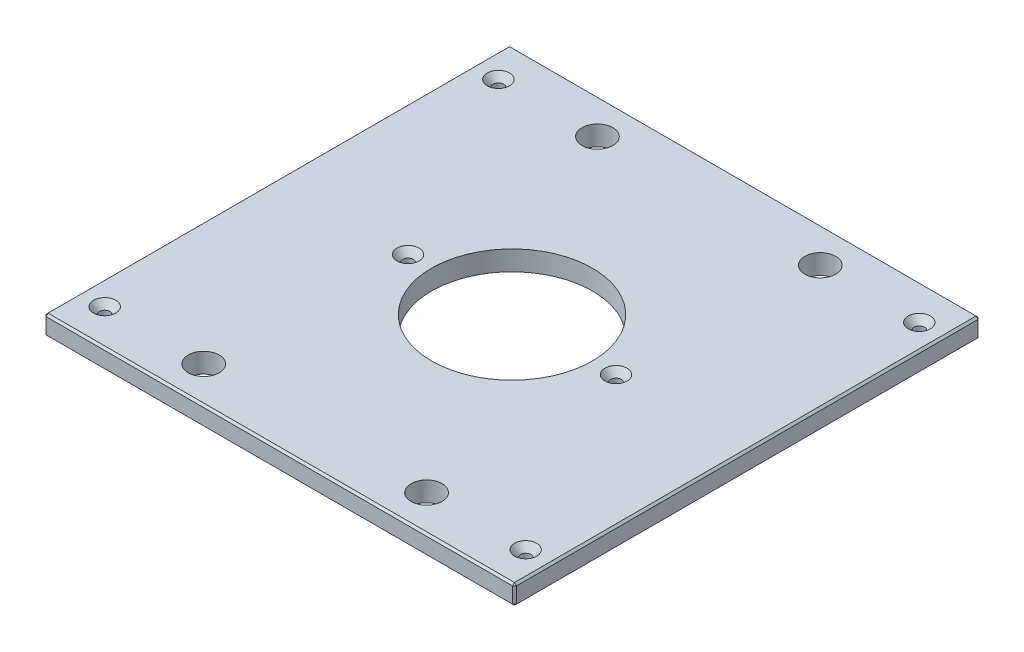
ISO-10303-21;
HEADER;
FILE_DESCRIPTION(('STEP AP214'),'2;1');
FILE_NAME('part.step','',(''),(''),'','','');
FILE_SCHEMA(('AUTOMOTIVE_DESIGN { 1 0 10303 214 1 1 1 1 }'));
ENDSEC;
DATA;
#1=APPLICATION_CONTEXT('core data for automotive mechanical design processes');
#2=APPLICATION_PROTOCOL_DEFINITION('international standard','automotive_design',2000,#1);
#3=PRODUCT_CONTEXT('',#1,'mechanical');
#4=PRODUCT('Part','Part','',(#3));
#5=PRODUCT_RELATED_PRODUCT_CATEGORY('part','',(#4));
#6=PRODUCT_DEFINITION_FORMATION('','',#4);
#7=PRODUCT_DEFINITION_CONTEXT('part definition',#1,'design');
#8=PRODUCT_DEFINITION('design','',#6,#7);
#9=PRODUCT_DEFINITION_SHAPE('','',#8);
#10=(LENGTH_UNIT() NAMED_UNIT(*) SI_UNIT(.MILLI.,.METRE.));
#11=(NAMED_UNIT(*) PLANE_ANGLE_UNIT() SI_UNIT($,.RADIAN.));
#12=(NAMED_UNIT(*) SI_UNIT($,.STERADIAN.) SOLID_ANGLE_UNIT());
#13=UNCERTAINTY_MEASURE_WITH_UNIT(LENGTH_MEASURE(1.E-05),#10,'distance_accuracy_value','');
#14=(GEOMETRIC_REPRESENTATION_CONTEXT(3) GLOBAL_UNCERTAINTY_ASSIGNED_CONTEXT((#13)) GLOBAL_UNIT_ASSIGNED_CONTEXT((#10,
#11,#12)) REPRESENTATION_CONTEXT('',''));
#15=CARTESIAN_POINT('',(0.,0.,0.));
#16=DIRECTION('',(0.,0.,1.));
#17=DIRECTION('',(1.,0.,0.));
#18=AXIS2_PLACEMENT_3D('',#15,#16,#17);
#19=CARTESIAN_POINT('',(-150.8125,12.7,-149.225));
#20=DIRECTION('',(1.,0.,0.));
#21=DIRECTION('',(0.,0.,-1.));
#22=AXIS2_PLACEMENT_3D('',#19,#20,#21);
#23=PLANE('',#22);
#24=DIRECTION('',(0.,0.,-1.));
#25=VECTOR('',#24,1.);
#26=CARTESIAN_POINT('',(-150.8125,11.43,-149.225));
#27=LINE('',#26,#25);
#28=CARTESIAN_POINT('',(-150.8125,11.43,147.955));
#29=VERTEX_POINT('',#28);
#30=CARTESIAN_POINT('',(-150.8125,11.43,-147.955));
#31=VERTEX_POINT('',#30);
#32=EDGE_CURVE('E135',#29,#31,#27,.T.);
#33=ORIENTED_EDGE('',*,*,#32,.T.);
#34=DIRECTION('',(0.,-1.,0.));
#35=VECTOR('',#34,1.);
#36=CARTESIAN_POINT('',(-150.8125,12.7,-147.955));
#37=LINE('',#36,#35);
#38=CARTESIAN_POINT('',(-150.8125,1.26999999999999,-147.955));
#39=VERTEX_POINT('',#38);
#40=EDGE_CURVE('E131',#31,#39,#37,.T.);
#41=ORIENTED_EDGE('',*,*,#40,.T.);
#42=DIRECTION('',(0.,0.,1.));
#43=VECTOR('',#42,1.);
#44=CARTESIAN_POINT('',(-150.8125,1.26999999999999,-149.225));
#45=LINE('',#44,#43);
#46=CARTESIAN_POINT('',(-150.8125,1.26999999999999,147.955));
#47=VERTEX_POINT('',#46);
#48=EDGE_CURVE('E126',#39,#47,#45,.T.);
#49=ORIENTED_EDGE('',*,*,#48,.T.);
#50=DIRECTION('',(0.,1.,0.));
#51=VECTOR('',#50,1.);
#52=CARTESIAN_POINT('',(-150.8125,12.7,147.955));
#53=LINE('',#52,#51);
#54=EDGE_CURVE('E128',#47,#29,#53,.T.);
#55=ORIENTED_EDGE('',*,*,#54,.T.);
#56=EDGE_LOOP('',(#33,#41,#49,#55));
#57=FACE_BOUND('',#56,.T.);
#58=ADVANCED_FACE('F35',(#57),#23,.F.);
#59=CARTESIAN_POINT('',(-150.8125,12.7,149.225));
#60=DIRECTION('',(0.,0.,-1.));
#61=DIRECTION('',(-1.,0.,0.));
#62=AXIS2_PLACEMENT_3D('',#59,#60,#61);
#63=PLANE('',#62);
#64=DIRECTION('',(1.,0.,0.));
#65=VECTOR('',#64,1.);
#66=CARTESIAN_POINT('',(-150.8125,1.26999999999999,149.225));
#67=LINE('',#66,#65);
#68=CARTESIAN_POINT('',(-149.5425,1.26999999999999,149.225));
#69=VERTEX_POINT('',#68);
#70=CARTESIAN_POINT('',(149.5425,1.26999999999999,149.225));
#71=VERTEX_POINT('',#70);
#72=EDGE_CURVE('E58',#69,#71,#67,.T.);
#73=ORIENTED_EDGE('',*,*,#72,.T.);
#74=DIRECTION('',(0.,1.,0.));
#75=VECTOR('',#74,1.);
#76=CARTESIAN_POINT('',(149.5425,12.7,149.225));
#77=LINE('',#76,#75);
#78=CARTESIAN_POINT('',(149.5425,11.43,149.225));
#79=VERTEX_POINT('',#78);
#80=EDGE_CURVE('E11',#71,#79,#77,.T.);
#81=ORIENTED_EDGE('',*,*,#80,.T.);
#82=DIRECTION('',(-1.,0.,0.));
#83=VECTOR('',#82,1.);
#84=CARTESIAN_POINT('',(-150.8125,11.43,149.225));
#85=LINE('',#84,#83);
#86=CARTESIAN_POINT('',(-149.5425,11.43,149.225));
#87=VERTEX_POINT('',#86);
#88=EDGE_CURVE('E44',#79,#87,#85,.T.);
#89=ORIENTED_EDGE('',*,*,#88,.T.);
#90=DIRECTION('',(0.,-1.,0.));
#91=VECTOR('',#90,1.);
#92=CARTESIAN_POINT('',(-149.5425,12.7,149.225));
#93=LINE('',#92,#91);
#94=EDGE_CURVE('E279',#87,#69,#93,.T.);
#95=ORIENTED_EDGE('',*,*,#94,.T.);
#96=EDGE_LOOP('',(#73,#81,#89,#95));
#97=FACE_BOUND('',#96,.T.);
#98=ADVANCED_FACE('F348',(#97),#63,.F.);
#99=CARTESIAN_POINT('',(150.8125,12.7,-149.225));
#100=DIRECTION('',(-1.,0.,0.));
#101=DIRECTION('',(0.,0.,1.));
#102=AXIS2_PLACEMENT_3D('',#99,#100,#101);
#103=PLANE('',#102);
#104=DIRECTION('',(0.,0.,-1.));
#105=VECTOR('',#104,1.);
#106=CARTESIAN_POINT('',(150.8125,1.26999999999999,-149.225));
#107=LINE('',#106,#105);
#108=CARTESIAN_POINT('',(150.8125,1.26999999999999,147.955));
#109=VERTEX_POINT('',#108);
#110=CARTESIAN_POINT('',(150.8125,1.26999999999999,-147.955));
#111=VERTEX_POINT('',#110);
#112=EDGE_CURVE('E274',#109,#111,#107,.T.);
#113=ORIENTED_EDGE('',*,*,#112,.T.);
#114=DIRECTION('',(0.,1.,0.));
#115=VECTOR('',#114,1.);
#116=CARTESIAN_POINT('',(150.8125,12.7,-147.955));
#117=LINE('',#116,#115);
#118=CARTESIAN_POINT('',(150.8125,11.43,-147.955));
#119=VERTEX_POINT('',#118);
#120=EDGE_CURVE('E276',#111,#119,#117,.T.);
#121=ORIENTED_EDGE('',*,*,#120,.T.);
#122=DIRECTION('',(0.,0.,1.));
#123=VECTOR('',#122,1.);
#124=CARTESIAN_POINT('',(150.8125,11.43,149.225));
#125=LINE('',#124,#123);
#126=CARTESIAN_POINT('',(150.8125,11.43,147.955));
#127=VERTEX_POINT('',#126);
#128=EDGE_CURVE('E272',#119,#127,#125,.T.);
#129=ORIENTED_EDGE('',*,*,#128,.T.);
#130=DIRECTION('',(0.,-1.,0.));
#131=VECTOR('',#130,1.);
#132=CARTESIAN_POINT('',(150.8125,12.7,147.955));
#133=LINE('',#132,#131);
#134=EDGE_CURVE('E270',#127,#109,#133,.T.);
#135=ORIENTED_EDGE('',*,*,#134,.T.);
#136=EDGE_LOOP('',(#113,#121,#129,#135));
#137=FACE_BOUND('',#136,.T.);
#138=ADVANCED_FACE('F335',(#137),#103,.F.);
#139=CARTESIAN_POINT('',(-150.8125,12.7,-149.225));
#140=DIRECTION('',(0.,0.,1.));
#141=DIRECTION('',(1.,0.,0.));
#142=AXIS2_PLACEMENT_3D('',#139,#140,#141);
#143=PLANE('',#142);
#144=DIRECTION('',(-1.,0.,0.));
#145=VECTOR('',#144,1.);
#146=CARTESIAN_POINT('',(-150.8125,1.26999999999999,-149.225));
#147=LINE('',#146,#145);
#148=CARTESIAN_POINT('',(149.5425,1.26999999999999,-149.225));
#149=VERTEX_POINT('',#148);
#150=CARTESIAN_POINT('',(-149.5425,1.26999999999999,-149.225));
#151=VERTEX_POINT('',#150);
#152=EDGE_CURVE('E246',#149,#151,#147,.T.);
#153=ORIENTED_EDGE('',*,*,#152,.T.);
#154=DIRECTION('',(0.,1.,0.));
#155=VECTOR('',#154,1.);
#156=CARTESIAN_POINT('',(-149.5425,12.7,-149.225));
#157=LINE('',#156,#155);
#158=CARTESIAN_POINT('',(-149.5425,11.43,-149.225));
#159=VERTEX_POINT('',#158);
#160=EDGE_CURVE('E250',#151,#159,#157,.T.);
#161=ORIENTED_EDGE('',*,*,#160,.T.);
#162=DIRECTION('',(1.,0.,0.));
#163=VECTOR('',#162,1.);
#164=CARTESIAN_POINT('',(150.8125,11.43,-149.225));
#165=LINE('',#164,#163);
#166=CARTESIAN_POINT('',(149.5425,11.43,-149.225));
#167=VERTEX_POINT('',#166);
#168=EDGE_CURVE('E248',#159,#167,#165,.T.);
#169=ORIENTED_EDGE('',*,*,#168,.T.);
#170=DIRECTION('',(0.,-1.,0.));
#171=VECTOR('',#170,1.);
#172=CARTESIAN_POINT('',(149.5425,12.7,-149.225));
#173=LINE('',#172,#171);
#174=EDGE_CURVE('E244',#167,#149,#173,.T.);
#175=ORIENTED_EDGE('',*,*,#174,.T.);
#176=EDGE_LOOP('',(#153,#161,#169,#175));
#177=FACE_BOUND('',#176,.T.);
#178=ADVANCED_FACE('F309',(#177),#143,.F.);
#179=CARTESIAN_POINT('',(0.,12.7,0.));
#180=DIRECTION('',(0.,1.,0.));
#181=DIRECTION('',(0.,0.,1.));
#182=AXIS2_PLACEMENT_3D('',#179,#180,#181);
#183=PLANE('',#182);
#184=CARTESIAN_POINT('',(134.9375,12.7,-126.20498));
#185=DIRECTION('',(0.,1.,0.));
#186=DIRECTION('',(0.,0.,1.));
#187=AXIS2_PLACEMENT_3D('',#184,#185,#186);
#188=CIRCLE('',#187,7.13739999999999);
#189=CARTESIAN_POINT('',(134.9375,12.7,-119.06758));
#190=VERTEX_POINT('',#189);
#191=EDGE_CURVE('E752',#190,#190,#188,.T.);
#192=ORIENTED_EDGE('',*,*,#191,.F.);
#193=EDGE_LOOP('',(#192));
#194=FACE_BOUND('',#193,.T.);
#195=CARTESIAN_POINT('',(134.9375,12.7,126.20498));
#196=DIRECTION('',(0.,1.,0.));
#197=DIRECTION('',(0.,0.,1.));
#198=AXIS2_PLACEMENT_3D('',#195,#196,#197);
#199=CIRCLE('',#198,7.13739999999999);
#200=CARTESIAN_POINT('',(134.9375,12.7,133.34238));
#201=VERTEX_POINT('',#200);
#202=EDGE_CURVE('E756',#201,#201,#199,.T.);
#203=ORIENTED_EDGE('',*,*,#202,.F.);
#204=EDGE_LOOP('',(#203));
#205=FACE_BOUND('',#204,.T.);
#206=CARTESIAN_POINT('',(-134.9375,12.7,126.20498));
#207=DIRECTION('',(0.,1.,0.));
#208=DIRECTION('',(0.,0.,1.));
#209=AXIS2_PLACEMENT_3D('',#206,#207,#208);
#210=CIRCLE('',#209,7.13739999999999);
#211=CARTESIAN_POINT('',(-134.9375,12.7,133.34238));
#212=VERTEX_POINT('',#211);
#213=EDGE_CURVE('E760',#212,#212,#210,.T.);
#214=ORIENTED_EDGE('',*,*,#213,.F.);
#215=EDGE_LOOP('',(#214));
#216=FACE_BOUND('',#215,.T.);
#217=CARTESIAN_POINT('',(-66.675,12.7,0.));
#218=DIRECTION('',(0.,1.,0.));
#219=DIRECTION('',(0.,0.,1.));
#220=AXIS2_PLACEMENT_3D('',#217,#218,#219);
#221=CIRCLE('',#220,7.1374);
#222=CARTESIAN_POINT('',(-66.675,12.7,7.1374));
#223=VERTEX_POINT('',#222);
#224=EDGE_CURVE('E764',#223,#223,#221,.T.);
#225=ORIENTED_EDGE('',*,*,#224,.F.);
#226=EDGE_LOOP('',(#225));
#227=FACE_BOUND('',#226,.T.);
#228=CARTESIAN_POINT('',(66.675,12.7,0.));
#229=DIRECTION('',(0.,1.,0.));
#230=DIRECTION('',(0.,0.,1.));
#231=AXIS2_PLACEMENT_3D('',#228,#229,#230);
#232=CIRCLE('',#231,7.1374);
#233=CARTESIAN_POINT('',(66.675,12.7,7.1374));
#234=VERTEX_POINT('',#233);
#235=EDGE_CURVE('E768',#234,#234,#232,.T.);
#236=ORIENTED_EDGE('',*,*,#235,.F.);
#237=EDGE_LOOP('',(#236));
#238=FACE_BOUND('',#237,.T.);
#239=CARTESIAN_POINT('',(-134.9375,12.7,-126.20498));
#240=DIRECTION('',(0.,1.,0.));
#241=DIRECTION('',(0.,0.,1.));
#242=AXIS2_PLACEMENT_3D('',#239,#240,#241);
#243=CIRCLE('',#242,7.13739999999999);
#244=CARTESIAN_POINT('',(-134.9375,12.7,-119.06758));
#245=VERTEX_POINT('',#244);
#246=EDGE_CURVE('E771',#245,#245,#243,.T.);
#247=ORIENTED_EDGE('',*,*,#246,.F.);
#248=EDGE_LOOP('',(#247));
#249=FACE_BOUND('',#248,.T.);
#250=DIRECTION('',(0.,0.,-1.));
#251=VECTOR('',#250,1.);
#252=CARTESIAN_POINT('',(149.5425,12.7,-149.225));
#253=LINE('',#252,#251);
#254=CARTESIAN_POINT('',(149.5425,12.7,147.955));
#255=VERTEX_POINT('',#254);
#256=CARTESIAN_POINT('',(149.5425,12.7,-147.955));
#257=VERTEX_POINT('',#256);
#258=EDGE_CURVE('E257',#255,#257,#253,.T.);
#259=ORIENTED_EDGE('',*,*,#258,.T.);
#260=DIRECTION('',(-1.,0.,0.));
#261=VECTOR('',#260,1.);
#262=CARTESIAN_POINT('',(-150.8125,12.7,-147.955));
#263=LINE('',#262,#261);
#264=CARTESIAN_POINT('',(-149.5425,12.7,-147.955));
#265=VERTEX_POINT('',#264);
#266=EDGE_CURVE('E259',#257,#265,#263,.T.);
#267=ORIENTED_EDGE('',*,*,#266,.T.);
#268=DIRECTION('',(0.,0.,1.));
#269=VECTOR('',#268,1.);
#270=CARTESIAN_POINT('',(-149.5425,12.7,149.225));
#271=LINE('',#270,#269);
#272=CARTESIAN_POINT('',(-149.5425,12.7,147.955));
#273=VERTEX_POINT('',#272);
#274=EDGE_CURVE('E255',#265,#273,#271,.T.);
#275=ORIENTED_EDGE('',*,*,#274,.T.);
#276=DIRECTION('',(1.,0.,0.));
#277=VECTOR('',#276,1.);
#278=CARTESIAN_POINT('',(150.8125,12.7,147.955));
#279=LINE('',#278,#277);
#280=EDGE_CURVE('E253',#273,#255,#279,.T.);
#281=ORIENTED_EDGE('',*,*,#280,.T.);
#282=EDGE_LOOP('',(#259,#267,#275,#281));
#283=FACE_BOUND('',#282,.T.);
#284=CARTESIAN_POINT('',(71.4375,12.7,-126.20498));
#285=DIRECTION('',(0.,1.,0.));
#286=DIRECTION('',(0.,0.,1.));
#287=AXIS2_PLACEMENT_3D('',#284,#285,#286);
#288=CIRCLE('',#287,9.921875);
#289=CARTESIAN_POINT('',(71.4375,12.7,-116.283105));
#290=VERTEX_POINT('',#289);
#291=EDGE_CURVE('E204',#290,#290,#288,.T.);
#292=ORIENTED_EDGE('',*,*,#291,.F.);
#293=EDGE_LOOP('',(#292));
#294=FACE_BOUND('',#293,.T.);
#295=CARTESIAN_POINT('',(-71.4375,12.7,-126.20498));
#296=DIRECTION('',(0.,1.,0.));
#297=DIRECTION('',(0.,0.,1.));
#298=AXIS2_PLACEMENT_3D('',#295,#296,#297);
#299=CIRCLE('',#298,9.921875);
#300=CARTESIAN_POINT('',(-71.4375,12.7,-116.283105));
#301=VERTEX_POINT('',#300);
#302=EDGE_CURVE('E214',#301,#301,#299,.T.);
#303=ORIENTED_EDGE('',*,*,#302,.F.);
#304=EDGE_LOOP('',(#303));
#305=FACE_BOUND('',#304,.T.);
#306=CARTESIAN_POINT('',(71.4375,12.7,126.20498));
#307=DIRECTION('',(0.,1.,0.));
#308=DIRECTION('',(0.,0.,1.));
#309=AXIS2_PLACEMENT_3D('',#306,#307,#308);
#310=CIRCLE('',#309,9.921875);
#311=CARTESIAN_POINT('',(71.4375,12.7,136.126855));
#312=VERTEX_POINT('',#311);
#313=EDGE_CURVE('E225',#312,#312,#310,.T.);
#314=ORIENTED_EDGE('',*,*,#313,.F.);
#315=EDGE_LOOP('',(#314));
#316=FACE_BOUND('',#315,.T.);
#317=CARTESIAN_POINT('',(-71.4375,12.7,126.20498));
#318=DIRECTION('',(0.,1.,0.));
#319=DIRECTION('',(0.,0.,1.));
#320=AXIS2_PLACEMENT_3D('',#317,#318,#319);
#321=CIRCLE('',#320,9.921875);
#322=CARTESIAN_POINT('',(-71.4375,12.7,136.126855));
#323=VERTEX_POINT('',#322);
#324=EDGE_CURVE('E231',#323,#323,#321,.T.);
#325=ORIENTED_EDGE('',*,*,#324,.F.);
#326=EDGE_LOOP('',(#325));
#327=FACE_BOUND('',#326,.T.);
#328=CARTESIAN_POINT('',(0.,12.7,0.));
#329=DIRECTION('',(0.,1.,0.));
#330=DIRECTION('',(0.,0.,1.));
#331=AXIS2_PLACEMENT_3D('',#328,#329,#330);
#332=CIRCLE('',#331,51.562);
#333=CARTESIAN_POINT('',(0.,12.7,51.562));
#334=VERTEX_POINT('',#333);
#335=EDGE_CURVE('E237',#334,#334,#332,.T.);
#336=ORIENTED_EDGE('',*,*,#335,.F.);
#337=EDGE_LOOP('',(#336));
#338=FACE_BOUND('',#337,.T.);
#339=ADVANCED_FACE('F357',(#194,#205,#216,#227,#238,#249,#283,#294,#305,#316,#327,#338),#183,.T.);
#340=CARTESIAN_POINT('',(0.,0.,0.));
#341=DIRECTION('',(0.,1.,0.));
#342=DIRECTION('',(0.,0.,1.));
#343=AXIS2_PLACEMENT_3D('',#340,#341,#342);
#344=PLANE('',#343);
#345=CARTESIAN_POINT('',(134.9375,0.,-126.20498));
#346=DIRECTION('',(0.,1.,0.));
#347=DIRECTION('',(0.,0.,1.));
#348=AXIS2_PLACEMENT_3D('',#345,#346,#347);
#349=CIRCLE('',#348,3.3782);
#350=CARTESIAN_POINT('',(134.9375,0.,-122.82678));
#351=VERTEX_POINT('',#350);
#352=EDGE_CURVE('E805',#351,#351,#349,.T.);
#353=ORIENTED_EDGE('',*,*,#352,.T.);
#354=EDGE_LOOP('',(#353));
#355=FACE_BOUND('',#354,.T.);
#356=CARTESIAN_POINT('',(134.9375,0.,126.20498));
#357=DIRECTION('',(0.,1.,0.));
#358=DIRECTION('',(0.,0.,1.));
#359=AXIS2_PLACEMENT_3D('',#356,#357,#358);
#360=CIRCLE('',#359,3.3782);
#361=CARTESIAN_POINT('',(134.9375,0.,129.58318));
#362=VERTEX_POINT('',#361);
#363=EDGE_CURVE('E798',#362,#362,#360,.T.);
#364=ORIENTED_EDGE('',*,*,#363,.T.);
#365=EDGE_LOOP('',(#364));
#366=FACE_BOUND('',#365,.T.);
#367=CARTESIAN_POINT('',(-134.9375,0.,126.20498));
#368=DIRECTION('',(0.,1.,0.));
#369=DIRECTION('',(0.,0.,1.));
#370=AXIS2_PLACEMENT_3D('',#367,#368,#369);
#371=CIRCLE('',#370,3.3782);
#372=CARTESIAN_POINT('',(-134.9375,0.,129.58318));
#373=VERTEX_POINT('',#372);
#374=EDGE_CURVE('E791',#373,#373,#371,.T.);
#375=ORIENTED_EDGE('',*,*,#374,.T.);
#376=EDGE_LOOP('',(#375));
#377=FACE_BOUND('',#376,.T.);
#378=CARTESIAN_POINT('',(-66.675,0.,0.));
#379=DIRECTION('',(0.,1.,0.));
#380=DIRECTION('',(0.,0.,1.));
#381=AXIS2_PLACEMENT_3D('',#378,#379,#380);
#382=CIRCLE('',#381,3.3782);
#383=CARTESIAN_POINT('',(-66.675,0.,3.3782));
#384=VERTEX_POINT('',#383);
#385=EDGE_CURVE('E784',#384,#384,#382,.T.);
#386=ORIENTED_EDGE('',*,*,#385,.T.);
#387=EDGE_LOOP('',(#386));
#388=FACE_BOUND('',#387,.T.);
#389=CARTESIAN_POINT('',(66.675,0.,0.));
#390=DIRECTION('',(0.,1.,0.));
#391=DIRECTION('',(0.,0.,1.));
#392=AXIS2_PLACEMENT_3D('',#389,#390,#391);
#393=CIRCLE('',#392,3.3782);
#394=CARTESIAN_POINT('',(66.675,0.,3.3782));
#395=VERTEX_POINT('',#394);
#396=EDGE_CURVE('E774',#395,#395,#393,.T.);
#397=ORIENTED_EDGE('',*,*,#396,.T.);
#398=EDGE_LOOP('',(#397));
#399=FACE_BOUND('',#398,.T.);
#400=CARTESIAN_POINT('',(-134.9375,0.,-126.20498));
#401=DIRECTION('',(0.,1.,0.));
#402=DIRECTION('',(0.,0.,1.));
#403=AXIS2_PLACEMENT_3D('',#400,#401,#402);
#404=CIRCLE('',#403,3.3782);
#405=CARTESIAN_POINT('',(-134.9375,0.,-122.82678));
#406=VERTEX_POINT('',#405);
#407=EDGE_CURVE('E217',#406,#406,#404,.T.);
#408=ORIENTED_EDGE('',*,*,#407,.T.);
#409=EDGE_LOOP('',(#408));
#410=FACE_BOUND('',#409,.T.);
#411=DIRECTION('',(0.,0.,-1.));
#412=VECTOR('',#411,1.);
#413=CARTESIAN_POINT('',(-149.5425,0.,0.));
#414=LINE('',#413,#412);
#415=CARTESIAN_POINT('',(-149.5425,0.,147.955));
#416=VERTEX_POINT('',#415);
#417=CARTESIAN_POINT('',(-149.5425,0.,-147.955));
#418=VERTEX_POINT('',#417);
#419=EDGE_CURVE('E158',#416,#418,#414,.T.);
#420=ORIENTED_EDGE('',*,*,#419,.T.);
#421=DIRECTION('',(1.,0.,0.));
#422=VECTOR('',#421,1.);
#423=CARTESIAN_POINT('',(0.,0.,-147.955));
#424=LINE('',#423,#422);
#425=CARTESIAN_POINT('',(149.5425,0.,-147.955));
#426=VERTEX_POINT('',#425);
#427=EDGE_CURVE('E267',#418,#426,#424,.T.);
#428=ORIENTED_EDGE('',*,*,#427,.T.);
#429=DIRECTION('',(0.,0.,1.));
#430=VECTOR('',#429,1.);
#431=CARTESIAN_POINT('',(149.5425,0.,0.));
#432=LINE('',#431,#430);
#433=CARTESIAN_POINT('',(149.5425,0.,147.955));
#434=VERTEX_POINT('',#433);
#435=EDGE_CURVE('E265',#426,#434,#432,.T.);
#436=ORIENTED_EDGE('',*,*,#435,.T.);
#437=DIRECTION('',(-1.,0.,0.));
#438=VECTOR('',#437,1.);
#439=CARTESIAN_POINT('',(0.,0.,147.955));
#440=LINE('',#439,#438);
#441=EDGE_CURVE('E262',#434,#416,#440,.T.);
#442=ORIENTED_EDGE('',*,*,#441,.T.);
#443=EDGE_LOOP('',(#420,#428,#436,#442));
#444=FACE_BOUND('',#443,.T.);
#445=CARTESIAN_POINT('',(71.4375,0.,-126.20498));
#446=DIRECTION('',(0.,1.,0.));
#447=DIRECTION('',(0.,0.,1.));
#448=AXIS2_PLACEMENT_3D('',#445,#446,#447);
#449=CIRCLE('',#448,9.921875);
#450=CARTESIAN_POINT('',(71.4375,0.,-116.283105));
#451=VERTEX_POINT('',#450);
#452=EDGE_CURVE('E209',#451,#451,#449,.T.);
#453=ORIENTED_EDGE('',*,*,#452,.T.);
#454=EDGE_LOOP('',(#453));
#455=FACE_BOUND('',#454,.T.);
#456=CARTESIAN_POINT('',(-71.4375,0.,-126.20498));
#457=DIRECTION('',(0.,1.,0.));
#458=DIRECTION('',(0.,0.,1.));
#459=AXIS2_PLACEMENT_3D('',#456,#457,#458);
#460=CIRCLE('',#459,9.921875);
#461=CARTESIAN_POINT('',(-71.4375,0.,-116.283105));
#462=VERTEX_POINT('',#461);
#463=EDGE_CURVE('E222',#462,#462,#460,.T.);
#464=ORIENTED_EDGE('',*,*,#463,.T.);
#465=EDGE_LOOP('',(#464));
#466=FACE_BOUND('',#465,.T.);
#467=CARTESIAN_POINT('',(71.4375,0.,126.20498));
#468=DIRECTION('',(0.,1.,0.));
#469=DIRECTION('',(0.,0.,1.));
#470=AXIS2_PLACEMENT_3D('',#467,#468,#469);
#471=CIRCLE('',#470,9.921875);
#472=CARTESIAN_POINT('',(71.4375,0.,136.126855));
#473=VERTEX_POINT('',#472);
#474=EDGE_CURVE('E228',#473,#473,#471,.T.);
#475=ORIENTED_EDGE('',*,*,#474,.T.);
#476=EDGE_LOOP('',(#475));
#477=FACE_BOUND('',#476,.T.);
#478=CARTESIAN_POINT('',(-71.4375,0.,126.20498));
#479=DIRECTION('',(0.,1.,0.));
#480=DIRECTION('',(0.,0.,1.));
#481=AXIS2_PLACEMENT_3D('',#478,#479,#480);
#482=CIRCLE('',#481,9.921875);
#483=CARTESIAN_POINT('',(-71.4375,0.,136.126855));
#484=VERTEX_POINT('',#483);
#485=EDGE_CURVE('E234',#484,#484,#482,.T.);
#486=ORIENTED_EDGE('',*,*,#485,.T.);
#487=EDGE_LOOP('',(#486));
#488=FACE_BOUND('',#487,.T.);
#489=CARTESIAN_POINT('',(0.,0.,0.));
#490=DIRECTION('',(0.,1.,0.));
#491=DIRECTION('',(0.,0.,1.));
#492=AXIS2_PLACEMENT_3D('',#489,#490,#491);
#493=CIRCLE('',#492,51.562);
#494=CARTESIAN_POINT('',(0.,0.,51.562));
#495=VERTEX_POINT('',#494);
#496=EDGE_CURVE('E147',#495,#495,#493,.T.);
#497=ORIENTED_EDGE('',*,*,#496,.T.);
#498=EDGE_LOOP('',(#497));
#499=FACE_BOUND('',#498,.T.);
#500=ADVANCED_FACE('F322',(#355,#366,#377,#388,#399,#410,#444,#455,#466,#477,#488,#499),#344,.F.);
#501=CARTESIAN_POINT('',(0.,0.,0.));
#502=DIRECTION('',(0.,1.,0.));
#503=DIRECTION('',(0.,0.,1.));
#504=AXIS2_PLACEMENT_3D('',#501,#502,#503);
#505=CYLINDRICAL_SURFACE('',#504,51.562);
#506=ORIENTED_EDGE('',*,*,#496,.F.);
#507=EDGE_LOOP('',(#506));
#508=FACE_BOUND('',#507,.T.);
#509=ORIENTED_EDGE('',*,*,#335,.T.);
#510=EDGE_LOOP('',(#509));
#511=FACE_BOUND('',#510,.T.);
#512=ADVANCED_FACE('F691',(#508,#511),#505,.F.);
#513=CARTESIAN_POINT('',(-71.4375,12.7,126.20498));
#514=DIRECTION('',(0.,1.,0.));
#515=DIRECTION('',(0.,0.,1.));
#516=AXIS2_PLACEMENT_3D('',#513,#514,#515);
#517=CYLINDRICAL_SURFACE('',#516,9.921875);
#518=ORIENTED_EDGE('',*,*,#485,.F.);
#519=EDGE_LOOP('',(#518));
#520=FACE_BOUND('',#519,.T.);
#521=ORIENTED_EDGE('',*,*,#324,.T.);
#522=EDGE_LOOP('',(#521));
#523=FACE_BOUND('',#522,.T.);
#524=ADVANCED_FACE('F682',(#520,#523),#517,.F.);
#525=CARTESIAN_POINT('',(71.4375,12.7,126.20498));
#526=DIRECTION('',(0.,1.,0.));
#527=DIRECTION('',(0.,0.,1.));
#528=AXIS2_PLACEMENT_3D('',#525,#526,#527);
#529=CYLINDRICAL_SURFACE('',#528,9.921875);
#530=ORIENTED_EDGE('',*,*,#474,.F.);
#531=EDGE_LOOP('',(#530));
#532=FACE_BOUND('',#531,.T.);
#533=ORIENTED_EDGE('',*,*,#313,.T.);
#534=EDGE_LOOP('',(#533));
#535=FACE_BOUND('',#534,.T.);
#536=ADVANCED_FACE('F673',(#532,#535),#529,.F.);
#537=CARTESIAN_POINT('',(-71.4375,12.7,-126.20498));
#538=DIRECTION('',(0.,1.,0.));
#539=DIRECTION('',(0.,0.,1.));
#540=AXIS2_PLACEMENT_3D('',#537,#538,#539);
#541=CYLINDRICAL_SURFACE('',#540,9.921875);
#542=ORIENTED_EDGE('',*,*,#463,.F.);
#543=EDGE_LOOP('',(#542));
#544=FACE_BOUND('',#543,.T.);
#545=ORIENTED_EDGE('',*,*,#302,.T.);
#546=EDGE_LOOP('',(#545));
#547=FACE_BOUND('',#546,.T.);
#548=ADVANCED_FACE('F663',(#544,#547),#541,.F.);
#549=CARTESIAN_POINT('',(71.4375,12.7,-126.20498));
#550=DIRECTION('',(0.,1.,0.));
#551=DIRECTION('',(0.,0.,1.));
#552=AXIS2_PLACEMENT_3D('',#549,#550,#551);
#553=CYLINDRICAL_SURFACE('',#552,9.921875);
#554=ORIENTED_EDGE('',*,*,#452,.F.);
#555=EDGE_LOOP('',(#554));
#556=FACE_BOUND('',#555,.T.);
#557=ORIENTED_EDGE('',*,*,#291,.T.);
#558=EDGE_LOOP('',(#557));
#559=FACE_BOUND('',#558,.T.);
#560=ADVANCED_FACE('F366',(#556,#559),#553,.F.);
#561=CARTESIAN_POINT('',(150.8125,12.7,147.955));
#562=DIRECTION('',(-0.707106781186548,0.,-0.707106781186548));
#563=DIRECTION('',(0.,-1.,0.));
#564=AXIS2_PLACEMENT_3D('',#561,#562,#563);
#565=PLANE('',#564);
#566=DIRECTION('',(-0.707106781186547,0.,0.707106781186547));
#567=VECTOR('',#566,1.);
#568=CARTESIAN_POINT('',(150.8125,11.43,147.955));
#569=LINE('',#568,#567);
#570=EDGE_CURVE('E39',#79,#127,#569,.F.);
#571=ORIENTED_EDGE('',*,*,#570,.F.);
#572=ORIENTED_EDGE('',*,*,#80,.F.);
#573=DIRECTION('',(0.707106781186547,0.,-0.707106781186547));
#574=VECTOR('',#573,1.);
#575=CARTESIAN_POINT('',(150.1775,1.26999999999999,148.59));
#576=LINE('',#575,#574);
#577=EDGE_CURVE('E197',#109,#71,#576,.F.);
#578=ORIENTED_EDGE('',*,*,#577,.F.);
#579=ORIENTED_EDGE('',*,*,#134,.F.);
#580=EDGE_LOOP('',(#571,#572,#578,#579));
#581=FACE_BOUND('',#580,.T.);
#582=ADVANCED_FACE('F37',(#581),#565,.F.);
#583=CARTESIAN_POINT('',(150.8125,11.43,147.955));
#584=DIRECTION('',(0.577350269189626,0.577350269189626,0.577350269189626));
#585=DIRECTION('',(0.707106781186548,0.,-0.707106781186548));
#586=AXIS2_PLACEMENT_3D('',#583,#584,#585);
#587=PLANE('',#586);
#588=DIRECTION('',(0.,-0.707106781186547,0.707106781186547));
#589=VECTOR('',#588,1.);
#590=CARTESIAN_POINT('',(149.5425,12.065,148.59));
#591=LINE('',#590,#589);
#592=EDGE_CURVE('E193',#79,#255,#591,.F.);
#593=ORIENTED_EDGE('',*,*,#592,.F.);
#594=ORIENTED_EDGE('',*,*,#570,.T.);
#595=DIRECTION('',(-0.707106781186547,0.707106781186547,0.));
#596=VECTOR('',#595,1.);
#597=CARTESIAN_POINT('',(150.8125,11.43,147.955));
#598=LINE('',#597,#596);
#599=EDGE_CURVE('E195',#255,#127,#598,.F.);
#600=ORIENTED_EDGE('',*,*,#599,.F.);
#601=EDGE_LOOP('',(#593,#594,#600));
#602=FACE_BOUND('',#601,.T.);
#603=ADVANCED_FACE('F359',(#602),#587,.T.);
#604=CARTESIAN_POINT('',(149.5425,0.,147.955));
#605=DIRECTION('',(0.577350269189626,-0.577350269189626,0.577350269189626));
#606=DIRECTION('',(0.707106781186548,0.,-0.707106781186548));
#607=AXIS2_PLACEMENT_3D('',#604,#605,#606);
#608=PLANE('',#607);
#609=DIRECTION('',(-0.707106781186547,-0.707106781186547,0.));
#610=VECTOR('',#609,1.);
#611=CARTESIAN_POINT('',(149.5425,0.,147.955));
#612=LINE('',#611,#610);
#613=EDGE_CURVE('E187',#109,#434,#612,.T.);
#614=ORIENTED_EDGE('',*,*,#613,.F.);
#615=ORIENTED_EDGE('',*,*,#577,.T.);
#616=DIRECTION('',(0.,0.707106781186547,0.707106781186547));
#617=VECTOR('',#616,1.);
#618=CARTESIAN_POINT('',(149.5425,0.,147.955));
#619=LINE('',#618,#617);
#620=EDGE_CURVE('E190',#434,#71,#619,.T.);
#621=ORIENTED_EDGE('',*,*,#620,.F.);
#622=EDGE_LOOP('',(#614,#615,#621));
#623=FACE_BOUND('',#622,.T.);
#624=ADVANCED_FACE('F328',(#623),#608,.T.);
#625=CARTESIAN_POINT('',(149.5425,12.7,0.));
#626=DIRECTION('',(0.707106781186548,0.707106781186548,0.));
#627=DIRECTION('',(0.,0.,1.));
#628=AXIS2_PLACEMENT_3D('',#625,#626,#627);
#629=PLANE('',#628);
#630=ORIENTED_EDGE('',*,*,#599,.T.);
#631=ORIENTED_EDGE('',*,*,#128,.F.);
#632=DIRECTION('',(0.707106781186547,-0.707106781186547,0.));
#633=VECTOR('',#632,1.);
#634=CARTESIAN_POINT('',(150.1775,12.065,-147.955));
#635=LINE('',#634,#633);
#636=EDGE_CURVE('E182',#257,#119,#635,.T.);
#637=ORIENTED_EDGE('',*,*,#636,.F.);
#638=ORIENTED_EDGE('',*,*,#258,.F.);
#639=EDGE_LOOP('',(#630,#631,#637,#638));
#640=FACE_BOUND('',#639,.T.);
#641=ADVANCED_FACE('F345',(#640),#629,.T.);
#642=CARTESIAN_POINT('',(0.,12.7,147.955));
#643=DIRECTION('',(0.,0.707106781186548,0.707106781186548));
#644=DIRECTION('',(-1.,0.,0.));
#645=AXIS2_PLACEMENT_3D('',#642,#643,#644);
#646=PLANE('',#645);
#647=ORIENTED_EDGE('',*,*,#592,.T.);
#648=ORIENTED_EDGE('',*,*,#280,.F.);
#649=DIRECTION('',(0.,0.707106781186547,-0.707106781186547));
#650=VECTOR('',#649,1.);
#651=CARTESIAN_POINT('',(-149.5425,12.7,147.955));
#652=LINE('',#651,#650);
#653=EDGE_CURVE('E179',#87,#273,#652,.T.);
#654=ORIENTED_EDGE('',*,*,#653,.F.);
#655=ORIENTED_EDGE('',*,*,#88,.F.);
#656=EDGE_LOOP('',(#647,#648,#654,#655));
#657=FACE_BOUND('',#656,.T.);
#658=ADVANCED_FACE('F350',(#657),#646,.T.);
#659=CARTESIAN_POINT('',(-149.5425,12.7,149.225));
#660=DIRECTION('',(0.707106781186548,0.,-0.707106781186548));
#661=DIRECTION('',(0.,-1.,0.));
#662=AXIS2_PLACEMENT_3D('',#659,#660,#661);
#663=PLANE('',#662);
#664=DIRECTION('',(0.707106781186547,0.,0.707106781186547));
#665=VECTOR('',#664,1.);
#666=CARTESIAN_POINT('',(-150.8125,1.26999999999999,147.955));
#667=LINE('',#666,#665);
#668=EDGE_CURVE('E142',#69,#47,#667,.F.);
#669=ORIENTED_EDGE('',*,*,#668,.F.);
#670=ORIENTED_EDGE('',*,*,#94,.F.);
#671=DIRECTION('',(-0.707106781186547,0.,-0.707106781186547));
#672=VECTOR('',#671,1.);
#673=CARTESIAN_POINT('',(-150.1775,11.43,148.59));
#674=LINE('',#673,#672);
#675=EDGE_CURVE('E145',#29,#87,#674,.F.);
#676=ORIENTED_EDGE('',*,*,#675,.F.);
#677=ORIENTED_EDGE('',*,*,#54,.F.);
#678=EDGE_LOOP('',(#669,#670,#676,#677));
#679=FACE_BOUND('',#678,.T.);
#680=ADVANCED_FACE('F140',(#679),#663,.F.);
#681=CARTESIAN_POINT('',(-150.8125,1.26999999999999,149.225));
#682=DIRECTION('',(0.,0.707106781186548,-0.707106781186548));
#683=DIRECTION('',(1.,0.,0.));
#684=AXIS2_PLACEMENT_3D('',#681,#682,#683);
#685=PLANE('',#684);
#686=ORIENTED_EDGE('',*,*,#620,.T.);
#687=ORIENTED_EDGE('',*,*,#72,.F.);
#688=DIRECTION('',(0.,-0.707106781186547,-0.707106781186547));
#689=VECTOR('',#688,1.);
#690=CARTESIAN_POINT('',(-149.5425,0.634999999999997,148.59));
#691=LINE('',#690,#689);
#692=EDGE_CURVE('E155',#416,#69,#691,.F.);
#693=ORIENTED_EDGE('',*,*,#692,.F.);
#694=ORIENTED_EDGE('',*,*,#441,.F.);
#695=EDGE_LOOP('',(#686,#687,#693,#694));
#696=FACE_BOUND('',#695,.T.);
#697=ADVANCED_FACE('F327',(#696),#685,.F.);
#698=CARTESIAN_POINT('',(150.8125,1.26999999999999,-149.225));
#699=DIRECTION('',(-0.707106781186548,0.707106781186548,0.));
#700=DIRECTION('',(0.,0.,-1.));
#701=AXIS2_PLACEMENT_3D('',#698,#699,#700);
#702=PLANE('',#701);
#703=ORIENTED_EDGE('',*,*,#613,.T.);
#704=ORIENTED_EDGE('',*,*,#435,.F.);
#705=DIRECTION('',(0.707106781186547,0.707106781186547,0.));
#706=VECTOR('',#705,1.);
#707=CARTESIAN_POINT('',(149.5425,0.,-147.955));
#708=LINE('',#707,#706);
#709=EDGE_CURVE('E174',#111,#426,#708,.F.);
#710=ORIENTED_EDGE('',*,*,#709,.F.);
#711=ORIENTED_EDGE('',*,*,#112,.F.);
#712=EDGE_LOOP('',(#703,#704,#710,#711));
#713=FACE_BOUND('',#712,.T.);
#714=ADVANCED_FACE('F332',(#713),#702,.F.);
#715=CARTESIAN_POINT('',(149.5425,12.7,-149.225));
#716=DIRECTION('',(-0.707106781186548,0.,0.707106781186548));
#717=DIRECTION('',(0.,-1.,0.));
#718=AXIS2_PLACEMENT_3D('',#715,#716,#717);
#719=PLANE('',#718);
#720=DIRECTION('',(0.707106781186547,0.,0.707106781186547));
#721=VECTOR('',#720,1.);
#722=CARTESIAN_POINT('',(149.5425,11.43,-149.225));
#723=LINE('',#722,#721);
#724=EDGE_CURVE('E184',#119,#167,#723,.F.);
#725=ORIENTED_EDGE('',*,*,#724,.F.);
#726=ORIENTED_EDGE('',*,*,#120,.F.);
#727=DIRECTION('',(-0.707106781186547,0.,-0.707106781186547));
#728=VECTOR('',#727,1.);
#729=CARTESIAN_POINT('',(150.1775,1.26999999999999,-148.59));
#730=LINE('',#729,#728);
#731=EDGE_CURVE('E171',#149,#111,#730,.F.);
#732=ORIENTED_EDGE('',*,*,#731,.F.);
#733=ORIENTED_EDGE('',*,*,#174,.F.);
#734=EDGE_LOOP('',(#725,#726,#732,#733));
#735=FACE_BOUND('',#734,.T.);
#736=ADVANCED_FACE('F340',(#735),#719,.F.);
#737=CARTESIAN_POINT('',(149.5425,11.43,-149.225));
#738=DIRECTION('',(0.577350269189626,0.577350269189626,-0.577350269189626));
#739=DIRECTION('',(-0.707106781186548,0.,-0.707106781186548));
#740=AXIS2_PLACEMENT_3D('',#737,#738,#739);
#741=PLANE('',#740);
#742=ORIENTED_EDGE('',*,*,#636,.T.);
#743=ORIENTED_EDGE('',*,*,#724,.T.);
#744=DIRECTION('',(0.,0.707106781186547,0.707106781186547));
#745=VECTOR('',#744,1.);
#746=CARTESIAN_POINT('',(149.5425,11.43,-149.225));
#747=LINE('',#746,#745);
#748=EDGE_CURVE('E163',#257,#167,#747,.F.);
#749=ORIENTED_EDGE('',*,*,#748,.F.);
#750=EDGE_LOOP('',(#742,#743,#749));
#751=FACE_BOUND('',#750,.T.);
#752=ADVANCED_FACE('F398',(#751),#741,.T.);
#753=CARTESIAN_POINT('',(-149.5425,12.7,147.955));
#754=DIRECTION('',(-0.577350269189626,0.577350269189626,0.577350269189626));
#755=DIRECTION('',(0.707106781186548,0.,0.707106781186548));
#756=AXIS2_PLACEMENT_3D('',#753,#754,#755);
#757=PLANE('',#756);
#758=ORIENTED_EDGE('',*,*,#675,.T.);
#759=ORIENTED_EDGE('',*,*,#653,.T.);
#760=DIRECTION('',(-0.707106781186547,-0.707106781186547,0.));
#761=VECTOR('',#760,1.);
#762=CARTESIAN_POINT('',(-149.5425,12.7,147.955));
#763=LINE('',#762,#761);
#764=EDGE_CURVE('E159',#29,#273,#763,.F.);
#765=ORIENTED_EDGE('',*,*,#764,.F.);
#766=EDGE_LOOP('',(#758,#759,#765));
#767=FACE_BOUND('',#766,.T.);
#768=ADVANCED_FACE('F352',(#767),#757,.T.);
#769=CARTESIAN_POINT('',(-150.8125,1.26999999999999,147.955));
#770=DIRECTION('',(-0.577350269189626,-0.577350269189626,0.577350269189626));
#771=DIRECTION('',(0.707106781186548,0.,0.707106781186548));
#772=AXIS2_PLACEMENT_3D('',#769,#770,#771);
#773=PLANE('',#772);
#774=ORIENTED_EDGE('',*,*,#692,.T.);
#775=ORIENTED_EDGE('',*,*,#668,.T.);
#776=DIRECTION('',(-0.707106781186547,0.707106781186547,0.));
#777=VECTOR('',#776,1.);
#778=CARTESIAN_POINT('',(-150.8125,1.26999999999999,147.955));
#779=LINE('',#778,#777);
#780=EDGE_CURVE('E152',#416,#47,#779,.T.);
#781=ORIENTED_EDGE('',*,*,#780,.F.);
#782=EDGE_LOOP('',(#774,#775,#781));
#783=FACE_BOUND('',#782,.T.);
#784=ADVANCED_FACE('F151',(#783),#773,.T.);
#785=CARTESIAN_POINT('',(149.5425,0.,-147.955));
#786=DIRECTION('',(0.577350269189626,-0.577350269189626,-0.577350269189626));
#787=DIRECTION('',(-0.707106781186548,0.,-0.707106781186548));
#788=AXIS2_PLACEMENT_3D('',#785,#786,#787);
#789=PLANE('',#788);
#790=ORIENTED_EDGE('',*,*,#731,.T.);
#791=ORIENTED_EDGE('',*,*,#709,.T.);
#792=DIRECTION('',(0.,-0.707106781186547,0.707106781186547));
#793=VECTOR('',#792,1.);
#794=CARTESIAN_POINT('',(149.5425,0.,-147.955));
#795=LINE('',#794,#793);
#796=EDGE_CURVE('E160',#149,#426,#795,.T.);
#797=ORIENTED_EDGE('',*,*,#796,.F.);
#798=EDGE_LOOP('',(#790,#791,#797));
#799=FACE_BOUND('',#798,.T.);
#800=ADVANCED_FACE('F390',(#799),#789,.T.);
#801=CARTESIAN_POINT('',(0.,12.7,-147.955));
#802=DIRECTION('',(0.,0.707106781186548,-0.707106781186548));
#803=DIRECTION('',(1.,0.,0.));
#804=AXIS2_PLACEMENT_3D('',#801,#802,#803);
#805=PLANE('',#804);
#806=ORIENTED_EDGE('',*,*,#748,.T.);
#807=ORIENTED_EDGE('',*,*,#168,.F.);
#808=DIRECTION('',(0.,-0.707106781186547,-0.707106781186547));
#809=VECTOR('',#808,1.);
#810=CARTESIAN_POINT('',(-149.5425,11.43,-149.225));
#811=LINE('',#810,#809);
#812=EDGE_CURVE('E165',#265,#159,#811,.T.);
#813=ORIENTED_EDGE('',*,*,#812,.F.);
#814=ORIENTED_EDGE('',*,*,#266,.F.);
#815=EDGE_LOOP('',(#806,#807,#813,#814));
#816=FACE_BOUND('',#815,.T.);
#817=ADVANCED_FACE('F304',(#816),#805,.T.);
#818=CARTESIAN_POINT('',(-149.5425,12.7,0.));
#819=DIRECTION('',(-0.707106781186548,0.707106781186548,0.));
#820=DIRECTION('',(0.,0.,-1.));
#821=AXIS2_PLACEMENT_3D('',#818,#819,#820);
#822=PLANE('',#821);
#823=ORIENTED_EDGE('',*,*,#764,.T.);
#824=ORIENTED_EDGE('',*,*,#274,.F.);
#825=DIRECTION('',(0.707106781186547,0.707106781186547,0.));
#826=VECTOR('',#825,1.);
#827=CARTESIAN_POINT('',(-150.1775,12.065,-147.955));
#828=LINE('',#827,#826);
#829=EDGE_CURVE('E293',#31,#265,#828,.T.);
#830=ORIENTED_EDGE('',*,*,#829,.F.);
#831=ORIENTED_EDGE('',*,*,#32,.F.);
#832=EDGE_LOOP('',(#823,#824,#830,#831));
#833=FACE_BOUND('',#832,.T.);
#834=ADVANCED_FACE('F355',(#833),#822,.T.);
#835=CARTESIAN_POINT('',(-150.8125,1.26999999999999,-149.225));
#836=DIRECTION('',(0.707106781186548,0.707106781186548,0.));
#837=DIRECTION('',(0.,0.,1.));
#838=AXIS2_PLACEMENT_3D('',#835,#836,#837);
#839=PLANE('',#838);
#840=ORIENTED_EDGE('',*,*,#780,.T.);
#841=ORIENTED_EDGE('',*,*,#48,.F.);
#842=DIRECTION('',(0.707106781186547,-0.707106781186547,0.));
#843=VECTOR('',#842,1.);
#844=CARTESIAN_POINT('',(-150.8125,1.26999999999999,-147.955));
#845=LINE('',#844,#843);
#846=EDGE_CURVE('E290',#418,#39,#845,.F.);
#847=ORIENTED_EDGE('',*,*,#846,.F.);
#848=ORIENTED_EDGE('',*,*,#419,.F.);
#849=EDGE_LOOP('',(#840,#841,#847,#848));
#850=FACE_BOUND('',#849,.T.);
#851=ADVANCED_FACE('F157',(#850),#839,.F.);
#852=CARTESIAN_POINT('',(-150.8125,1.26999999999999,-149.225));
#853=DIRECTION('',(0.,0.707106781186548,0.707106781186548));
#854=DIRECTION('',(-1.,0.,0.));
#855=AXIS2_PLACEMENT_3D('',#852,#853,#854);
#856=PLANE('',#855);
#857=ORIENTED_EDGE('',*,*,#796,.T.);
#858=ORIENTED_EDGE('',*,*,#427,.F.);
#859=DIRECTION('',(0.,0.707106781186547,-0.707106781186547));
#860=VECTOR('',#859,1.);
#861=CARTESIAN_POINT('',(-149.5425,0.634999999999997,-148.59));
#862=LINE('',#861,#860);
#863=EDGE_CURVE('E287',#151,#418,#862,.F.);
#864=ORIENTED_EDGE('',*,*,#863,.F.);
#865=ORIENTED_EDGE('',*,*,#152,.F.);
#866=EDGE_LOOP('',(#857,#858,#864,#865));
#867=FACE_BOUND('',#866,.T.);
#868=ADVANCED_FACE('F319',(#867),#856,.F.);
#869=CARTESIAN_POINT('',(-149.5425,11.43,-149.225));
#870=DIRECTION('',(-0.577350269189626,0.577350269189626,-0.577350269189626));
#871=DIRECTION('',(-0.707106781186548,0.,0.707106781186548));
#872=AXIS2_PLACEMENT_3D('',#869,#870,#871);
#873=PLANE('',#872);
#874=ORIENTED_EDGE('',*,*,#829,.T.);
#875=ORIENTED_EDGE('',*,*,#812,.T.);
#876=DIRECTION('',(0.707106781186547,0.,-0.707106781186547));
#877=VECTOR('',#876,1.);
#878=CARTESIAN_POINT('',(-149.5425,11.43,-149.225));
#879=LINE('',#878,#877);
#880=EDGE_CURVE('E285',#31,#159,#879,.T.);
#881=ORIENTED_EDGE('',*,*,#880,.F.);
#882=EDGE_LOOP('',(#874,#875,#881));
#883=FACE_BOUND('',#882,.T.);
#884=ADVANCED_FACE('F299',(#883),#873,.T.);
#885=CARTESIAN_POINT('',(-150.8125,1.26999999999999,-147.955));
#886=DIRECTION('',(-0.577350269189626,-0.577350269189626,-0.577350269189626));
#887=DIRECTION('',(-0.707106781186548,0.,0.707106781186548));
#888=AXIS2_PLACEMENT_3D('',#885,#886,#887);
#889=PLANE('',#888);
#890=ORIENTED_EDGE('',*,*,#863,.T.);
#891=ORIENTED_EDGE('',*,*,#846,.T.);
#892=DIRECTION('',(-0.707106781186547,0.,0.707106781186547));
#893=VECTOR('',#892,1.);
#894=CARTESIAN_POINT('',(-150.8125,1.26999999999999,-147.955));
#895=LINE('',#894,#893);
#896=EDGE_CURVE('E283',#151,#39,#895,.T.);
#897=ORIENTED_EDGE('',*,*,#896,.F.);
#898=EDGE_LOOP('',(#890,#891,#897));
#899=FACE_BOUND('',#898,.T.);
#900=ADVANCED_FACE('F316',(#899),#889,.T.);
#901=CARTESIAN_POINT('',(-150.8125,12.7,-147.955));
#902=DIRECTION('',(0.707106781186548,0.,0.707106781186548));
#903=DIRECTION('',(0.,-1.,0.));
#904=AXIS2_PLACEMENT_3D('',#901,#902,#903);
#905=PLANE('',#904);
#906=ORIENTED_EDGE('',*,*,#880,.T.);
#907=ORIENTED_EDGE('',*,*,#160,.F.);
#908=ORIENTED_EDGE('',*,*,#896,.T.);
#909=ORIENTED_EDGE('',*,*,#40,.F.);
#910=EDGE_LOOP('',(#906,#907,#908,#909));
#911=FACE_BOUND('',#910,.T.);
#912=ADVANCED_FACE('F314',(#911),#905,.F.);
#913=CARTESIAN_POINT('',(-134.9375,12.7,-126.20498));
#914=DIRECTION('',(0.,1.,0.));
#915=DIRECTION('',(0.,0.,1.));
#916=AXIS2_PLACEMENT_3D('',#913,#914,#915);
#917=CYLINDRICAL_SURFACE('',#916,3.3782);
#918=ORIENTED_EDGE('',*,*,#407,.F.);
#919=EDGE_LOOP('',(#918));
#920=FACE_BOUND('',#919,.T.);
#921=CARTESIAN_POINT('',(-134.9375,8.37553508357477,-126.20498));
#922=DIRECTION('',(0.,1.,0.));
#923=DIRECTION('',(0.,0.,1.));
#924=AXIS2_PLACEMENT_3D('',#921,#922,#923);
#925=CIRCLE('',#924,3.3782);
#926=CARTESIAN_POINT('',(-134.9375,8.37553508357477,-122.82678));
#927=VERTEX_POINT('',#926);
#928=EDGE_CURVE('E773',#927,#927,#925,.T.);
#929=ORIENTED_EDGE('',*,*,#928,.T.);
#930=EDGE_LOOP('',(#929));
#931=FACE_BOUND('',#930,.T.);
#932=ADVANCED_FACE('F377',(#920,#931),#917,.F.);
#933=CARTESIAN_POINT('',(-134.9375,12.7,-126.20498));
#934=DIRECTION('',(0.,1.,0.));
#935=DIRECTION('',(0.,0.,1.));
#936=AXIS2_PLACEMENT_3D('',#933,#934,#935);
#937=CONICAL_SURFACE('',#936,7.13739999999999,0.715584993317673);
#938=ORIENTED_EDGE('',*,*,#928,.F.);
#939=EDGE_LOOP('',(#938));
#940=FACE_BOUND('',#939,.T.);
#941=ORIENTED_EDGE('',*,*,#246,.T.);
#942=EDGE_LOOP('',(#941));
#943=FACE_BOUND('',#942,.T.);
#944=ADVANCED_FACE('F487',(#940,#943),#937,.F.);
#945=CARTESIAN_POINT('',(66.675,12.7,0.));
#946=DIRECTION('',(0.,1.,0.));
#947=DIRECTION('',(0.,0.,1.));
#948=AXIS2_PLACEMENT_3D('',#945,#946,#947);
#949=CYLINDRICAL_SURFACE('',#948,3.3782);
#950=ORIENTED_EDGE('',*,*,#396,.F.);
#951=EDGE_LOOP('',(#950));
#952=FACE_BOUND('',#951,.T.);
#953=CARTESIAN_POINT('',(66.675,8.37553508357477,0.));
#954=DIRECTION('',(0.,1.,0.));
#955=DIRECTION('',(0.,0.,1.));
#956=AXIS2_PLACEMENT_3D('',#953,#954,#955);
#957=CIRCLE('',#956,3.3782);
#958=CARTESIAN_POINT('',(66.675,8.37553508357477,3.3782));
#959=VERTEX_POINT('',#958);
#960=EDGE_CURVE('E778',#959,#959,#957,.T.);
#961=ORIENTED_EDGE('',*,*,#960,.T.);
#962=EDGE_LOOP('',(#961));
#963=FACE_BOUND('',#962,.T.);
#964=ADVANCED_FACE('F496',(#952,#963),#949,.F.);
#965=CARTESIAN_POINT('',(66.675,12.7,0.));
#966=DIRECTION('',(0.,1.,0.));
#967=DIRECTION('',(0.,0.,1.));
#968=AXIS2_PLACEMENT_3D('',#965,#966,#967);
#969=CONICAL_SURFACE('',#968,7.1374,0.715584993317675);
#970=ORIENTED_EDGE('',*,*,#960,.F.);
#971=EDGE_LOOP('',(#970));
#972=FACE_BOUND('',#971,.T.);
#973=ORIENTED_EDGE('',*,*,#235,.T.);
#974=EDGE_LOOP('',(#973));
#975=FACE_BOUND('',#974,.T.);
#976=ADVANCED_FACE('F504',(#972,#975),#969,.F.);
#977=CARTESIAN_POINT('',(-66.675,12.7,0.));
#978=DIRECTION('',(0.,1.,0.));
#979=DIRECTION('',(0.,0.,1.));
#980=AXIS2_PLACEMENT_3D('',#977,#978,#979);
#981=CYLINDRICAL_SURFACE('',#980,3.3782);
#982=ORIENTED_EDGE('',*,*,#385,.F.);
#983=EDGE_LOOP('',(#982));
#984=FACE_BOUND('',#983,.T.);
#985=CARTESIAN_POINT('',(-66.675,8.37553508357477,0.));
#986=DIRECTION('',(0.,1.,0.));
#987=DIRECTION('',(0.,0.,1.));
#988=AXIS2_PLACEMENT_3D('',#985,#986,#987);
#989=CIRCLE('',#988,3.3782);
#990=CARTESIAN_POINT('',(-66.675,8.37553508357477,3.3782));
#991=VERTEX_POINT('',#990);
#992=EDGE_CURVE('E787',#991,#991,#989,.T.);
#993=ORIENTED_EDGE('',*,*,#992,.T.);
#994=EDGE_LOOP('',(#993));
#995=FACE_BOUND('',#994,.T.);
#996=ADVANCED_FACE('F512',(#984,#995),#981,.F.);
#997=CARTESIAN_POINT('',(-66.675,12.7,0.));
#998=DIRECTION('',(0.,1.,0.));
#999=DIRECTION('',(0.,0.,1.));
#1000=AXIS2_PLACEMENT_3D('',#997,#998,#999);
#1001=CONICAL_SURFACE('',#1000,7.1374,0.715584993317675);
#1002=ORIENTED_EDGE('',*,*,#992,.F.);
#1003=EDGE_LOOP('',(#1002));
#1004=FACE_BOUND('',#1003,.T.);
#1005=ORIENTED_EDGE('',*,*,#224,.T.);
#1006=EDGE_LOOP('',(#1005));
#1007=FACE_BOUND('',#1006,.T.);
#1008=ADVANCED_FACE('F520',(#1004,#1007),#1001,.F.);
#1009=CARTESIAN_POINT('',(-134.9375,12.7,126.20498));
#1010=DIRECTION('',(0.,1.,0.));
#1011=DIRECTION('',(0.,0.,1.));
#1012=AXIS2_PLACEMENT_3D('',#1009,#1010,#1011);
#1013=CYLINDRICAL_SURFACE('',#1012,3.3782);
#1014=ORIENTED_EDGE('',*,*,#374,.F.);
#1015=EDGE_LOOP('',(#1014));
#1016=FACE_BOUND('',#1015,.T.);
#1017=CARTESIAN_POINT('',(-134.9375,8.37553508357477,126.20498));
#1018=DIRECTION('',(0.,1.,0.));
#1019=DIRECTION('',(0.,0.,1.));
#1020=AXIS2_PLACEMENT_3D('',#1017,#1018,#1019);
#1021=CIRCLE('',#1020,3.3782);
#1022=CARTESIAN_POINT('',(-134.9375,8.37553508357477,129.58318));
#1023=VERTEX_POINT('',#1022);
#1024=EDGE_CURVE('E794',#1023,#1023,#1021,.T.);
#1025=ORIENTED_EDGE('',*,*,#1024,.T.);
#1026=EDGE_LOOP('',(#1025));
#1027=FACE_BOUND('',#1026,.T.);
#1028=ADVANCED_FACE('F528',(#1016,#1027),#1013,.F.);
#1029=CARTESIAN_POINT('',(-134.9375,12.7,126.20498));
#1030=DIRECTION('',(0.,1.,0.));
#1031=DIRECTION('',(0.,0.,1.));
#1032=AXIS2_PLACEMENT_3D('',#1029,#1030,#1031);
#1033=CONICAL_SURFACE('',#1032,7.13739999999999,0.715584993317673);
#1034=ORIENTED_EDGE('',*,*,#1024,.F.);
#1035=EDGE_LOOP('',(#1034));
#1036=FACE_BOUND('',#1035,.T.);
#1037=ORIENTED_EDGE('',*,*,#213,.T.);
#1038=EDGE_LOOP('',(#1037));
#1039=FACE_BOUND('',#1038,.T.);
#1040=ADVANCED_FACE('F536',(#1036,#1039),#1033,.F.);
#1041=CARTESIAN_POINT('',(134.9375,12.7,126.20498));
#1042=DIRECTION('',(0.,1.,0.));
#1043=DIRECTION('',(0.,0.,1.));
#1044=AXIS2_PLACEMENT_3D('',#1041,#1042,#1043);
#1045=CYLINDRICAL_SURFACE('',#1044,3.3782);
#1046=ORIENTED_EDGE('',*,*,#363,.F.);
#1047=EDGE_LOOP('',(#1046));
#1048=FACE_BOUND('',#1047,.T.);
#1049=CARTESIAN_POINT('',(134.9375,8.37553508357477,126.20498));
#1050=DIRECTION('',(0.,1.,0.));
#1051=DIRECTION('',(0.,0.,1.));
#1052=AXIS2_PLACEMENT_3D('',#1049,#1050,#1051);
#1053=CIRCLE('',#1052,3.3782);
#1054=CARTESIAN_POINT('',(134.9375,8.37553508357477,129.58318));
#1055=VERTEX_POINT('',#1054);
#1056=EDGE_CURVE('E801',#1055,#1055,#1053,.T.);
#1057=ORIENTED_EDGE('',*,*,#1056,.T.);
#1058=EDGE_LOOP('',(#1057));
#1059=FACE_BOUND('',#1058,.T.);
#1060=ADVANCED_FACE('F544',(#1048,#1059),#1045,.F.);
#1061=CARTESIAN_POINT('',(134.9375,12.7,126.20498));
#1062=DIRECTION('',(0.,1.,0.));
#1063=DIRECTION('',(0.,0.,1.));
#1064=AXIS2_PLACEMENT_3D('',#1061,#1062,#1063);
#1065=CONICAL_SURFACE('',#1064,7.13739999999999,0.715584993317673);
#1066=ORIENTED_EDGE('',*,*,#1056,.F.);
#1067=EDGE_LOOP('',(#1066));
#1068=FACE_BOUND('',#1067,.T.);
#1069=ORIENTED_EDGE('',*,*,#202,.T.);
#1070=EDGE_LOOP('',(#1069));
#1071=FACE_BOUND('',#1070,.T.);
#1072=ADVANCED_FACE('F552',(#1068,#1071),#1065,.F.);
#1073=CARTESIAN_POINT('',(134.9375,12.7,-126.20498));
#1074=DIRECTION('',(0.,1.,0.));
#1075=DIRECTION('',(0.,0.,1.));
#1076=AXIS2_PLACEMENT_3D('',#1073,#1074,#1075);
#1077=CYLINDRICAL_SURFACE('',#1076,3.3782);
#1078=ORIENTED_EDGE('',*,*,#352,.F.);
#1079=EDGE_LOOP('',(#1078));
#1080=FACE_BOUND('',#1079,.T.);
#1081=CARTESIAN_POINT('',(134.9375,8.37553508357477,-126.20498));
#1082=DIRECTION('',(0.,1.,0.));
#1083=DIRECTION('',(0.,0.,1.));
#1084=AXIS2_PLACEMENT_3D('',#1081,#1082,#1083);
#1085=CIRCLE('',#1084,3.3782);
#1086=CARTESIAN_POINT('',(134.9375,8.37553508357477,-122.82678));
#1087=VERTEX_POINT('',#1086);
#1088=EDGE_CURVE('E808',#1087,#1087,#1085,.T.);
#1089=ORIENTED_EDGE('',*,*,#1088,.T.);
#1090=EDGE_LOOP('',(#1089));
#1091=FACE_BOUND('',#1090,.T.);
#1092=ADVANCED_FACE('F560',(#1080,#1091),#1077,.F.);
#1093=CARTESIAN_POINT('',(134.9375,12.7,-126.20498));
#1094=DIRECTION('',(0.,1.,0.));
#1095=DIRECTION('',(0.,0.,1.));
#1096=AXIS2_PLACEMENT_3D('',#1093,#1094,#1095);
#1097=CONICAL_SURFACE('',#1096,7.13739999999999,0.715584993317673);
#1098=ORIENTED_EDGE('',*,*,#1088,.F.);
#1099=EDGE_LOOP('',(#1098));
#1100=FACE_BOUND('',#1099,.T.);
#1101=ORIENTED_EDGE('',*,*,#191,.T.);
#1102=EDGE_LOOP('',(#1101));
#1103=FACE_BOUND('',#1102,.T.);
#1104=ADVANCED_FACE('F568',(#1100,#1103),#1097,.F.);
#1105=CLOSED_SHELL('',(#58,#98,#138,#178,#339,#500,#512,#524,#536,#548,#560,#582,#603,#624,#641,
#658,#680,#697,#714,#736,#752,#768,#784,#800,#817,#834,#851,#868,#884,#900,#912,#932,#944,#964,
#976,#996,#1008,#1028,#1040,#1060,#1072,#1092,#1104));
#1106=MANIFOLD_SOLID_BREP('B2',#1105);
#1107=ADVANCED_BREP_SHAPE_REPRESENTATION('',(#18,#1106),#14);
#1108=SHAPE_DEFINITION_REPRESENTATION(#9,#1107);
ENDSEC;
END-ISO-10303-21;
